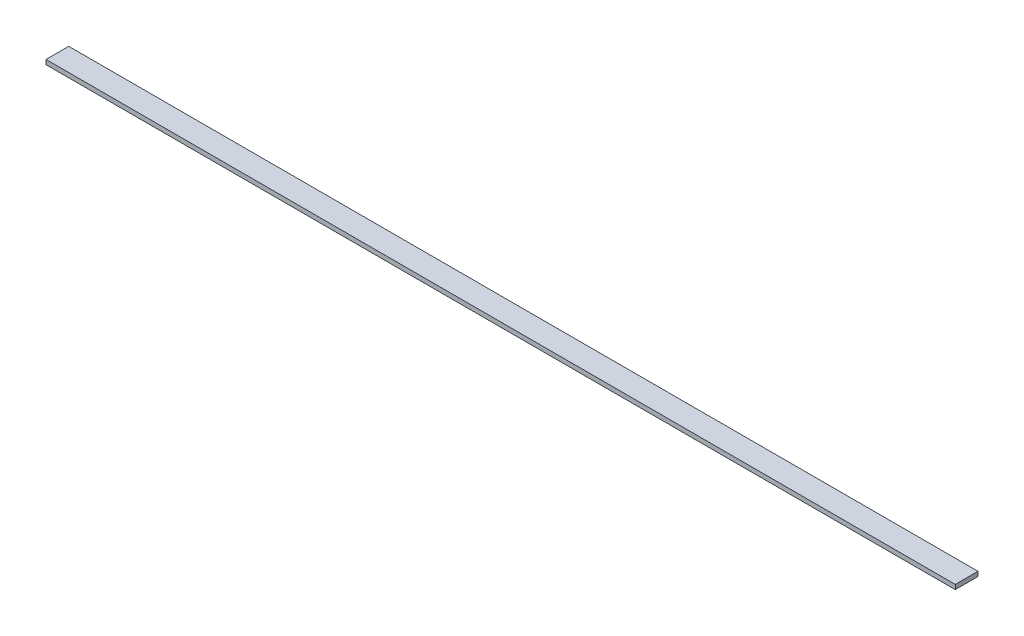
from build123d import *

# Parameters (mm, degrees)
ESQUISSE1_W      = 20000
ESQUISSE1_H      = 100
EXTRUSION1_DEPTH = 250


with BuildPart() as part:
    # Esquisse1 → Extrusion1 (new, symmetric)
    with BuildSketch(Plane.XY):
        with Locations((10000, 50)):
            Rectangle(ESQUISSE1_W, ESQUISSE1_H)
    extrude(amount=EXTRUSION1_DEPTH, both=True)


solid = part.part
